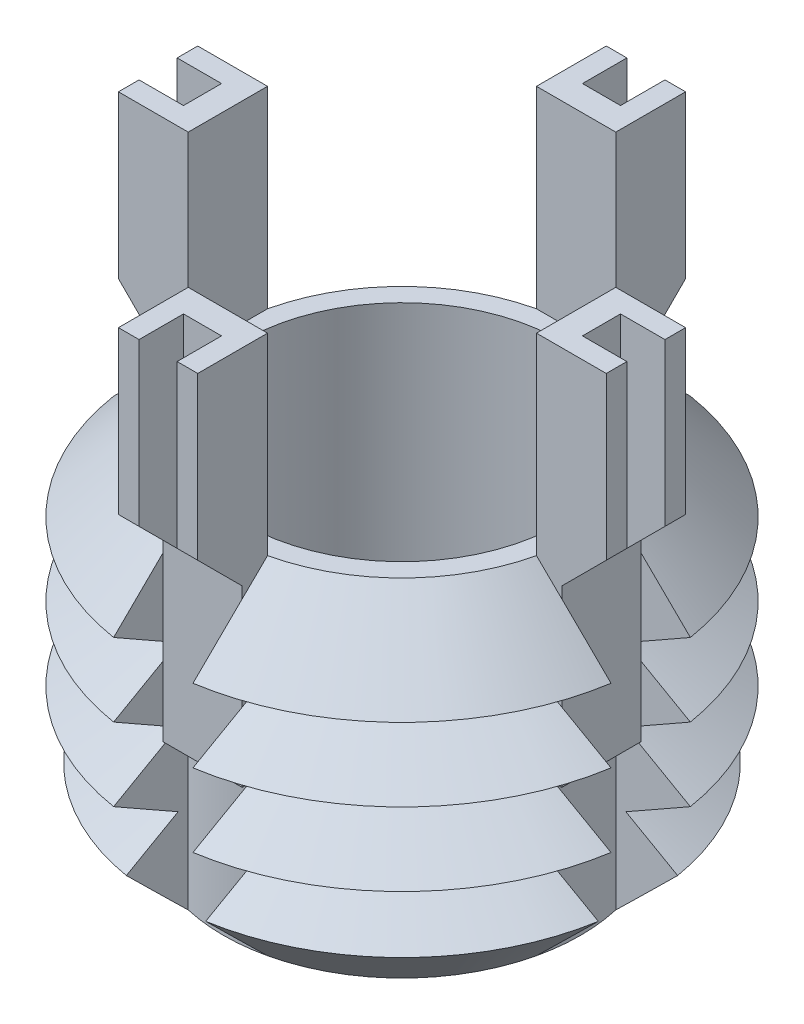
from build123d import *

# Parameters (mm, degrees)
SKETCH1_R           = 7.9375
BOSS_EXTRUDE1_DEPTH = 10.922
CHAMFER1_SIZE       = 2.309
LPATTERN1_COUNT     = 3
LPATTERN1_PITCH     = 2.309
CUT_EXTRUDE1_REACH  = 17.662
CIRPATTERN1_COUNT   = 4
BOSS_EXTRUDE3_DEPTH = 1.25
CIRPATTERN2_COUNT   = 4
CUT_EXTRUDE3_REACH  = 22.291
SKETCH6_W           = 1.4
SKETCH6_H           = 1.2
SKETCH6_W_2         = 1.2
SKETCH6_H_2         = 1.4
SKETCH7_R           = 5
CUT_EXTRUDE4_DEPTH  = 10.922


with BuildPart() as part:
    # Sketch1 → Boss-Extrude1 (new body)
    with BuildSketch(Plane(origin=(0, 0, 0), x_dir=(1, 0, 0), z_dir=(0, 1, 0))):
        with Locations(Location((0, 0, 0), (0, 0, 270))):
            Circle(SKETCH1_R)
    extrude(amount=-BOSS_EXTRUDE1_DEPTH)

    # Chamfer1
    chamfer1_edges = [part.edges().sort_by_distance(p)[0] for p in [
        (0, 0, -7.9375),
        (0, -10.922, -7.9375),
    ]]
    chamfer(chamfer1_edges, length=CHAMFER1_SIZE)

    # Sketch3 → Cut-Revolve1 (revolve, cut)
    with BuildSketch(Plane(origin=(0, 0, 0), x_dir=(0, 0, -1), z_dir=(1, 0, 0))):
        Polygon((-7.9375, -2.309), (-5.937847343, -3.4635), (-7.9375, -4.618), align=None)
    cut_revolve1 = revolve(axis=Axis((0, 0.885892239, 0), (0, -1, 0)), mode=Mode.SUBTRACT)

    # LPattern1: Cut-Revolve1 ×3
    with Locations(*[(0, -i * LPATTERN1_PITCH, 0) for i in range(1, LPATTERN1_COUNT)]):
        add(cut_revolve1, mode=Mode.SUBTRACT)

    # Cut-Extrude1: up to this cone (the profile starts inside it)
    cut_extrude1_end = Plane(origin=(0, 0, 0), z_dir=(0, 1, 0)).offset(-16.550499) * Cone(1e-06, 51.263, 51.262999, align=(Align.CENTER, Align.CENTER, Align.MIN), mode=Mode.PRIVATE)
    # Sketch4 → Cut-Extrude1 (cut, up to the surface)
    with BuildSketch(Plane(origin=(0, 0, 0), x_dir=(1, 0, 0), z_dir=(0, 1, 0)), mode=Mode.PRIVATE) as cut_extrude1_sk1:
        with BuildLine():
            Line((-5.487942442, 1.25), (-7.838456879, 1.25))
            ThreePointArc((-7.838456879, 1.25), (-7.9375, 0), (-7.838456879, -1.25))
            Line((-7.838456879, -1.25), (-5.487942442, -1.25))
            ThreePointArc((-5.487942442, -1.25), (-5.6285, 0), (-5.487942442, 1.25))
        make_face()
    cut_extrude1_tool1 = extrude(cut_extrude1_sk1.sketch, amount=-CUT_EXTRUDE1_REACH, mode=Mode.PRIVATE) & cut_extrude1_end
    cut_extrude1 = cut_extrude1_tool1.solids().sort_by_distance((-6.743037, 0, 0))[0]
    add(cut_extrude1, mode=Mode.SUBTRACT)

    # CirPattern1: Cut-Extrude1 ×4 about axis
    cirpattern1_axis = Axis((0, 0, 0), (0, 1, 0))
    for i in range(1, CIRPATTERN1_COUNT):
        add(cut_extrude1.rotate(cirpattern1_axis, i * 360 / CIRPATTERN1_COUNT), mode=Mode.SUBTRACT)

    # Sketch5 → Boss-Extrude3 (add, symmetric)
    with BuildSketch(Plane(origin=(0, 0, 0), x_dir=(0, 0, -1), z_dir=(1, 0, 0))):
        Polygon((-5.487942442, 6.073), (-5.487942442, -5.927), (-6.287942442, -5.927), (-6.287942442, -0.427), (-7.687942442, 0.973), (-7.687942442, 6.073), align=None)
    boss_extrude3 = extrude(amount=BOSS_EXTRUDE3_DEPTH, both=True)

    # CirPattern2: Boss-Extrude3 ×4 about axis
    cirpattern2_axis = Axis((0, 0, 0), (0, 1, 0))
    for i in range(1, CIRPATTERN2_COUNT):
        add(boss_extrude3.rotate(cirpattern2_axis, i * 360 / CIRPATTERN2_COUNT))

    # Cut-Extrude3: up to this plane
    cut_extrude3_end = Plane(origin=(-6.287942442, -0.427, 1.25), z_dir=(0.7071067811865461, 0.7071067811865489, -7.40655039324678e-15))
    # Sketch6 → Cut-Extrude3 (cut, up to the surface)
    with BuildSketch(Plane(origin=(0, 6.073, 0), x_dir=(1, 0, 0), z_dir=(0, 1, 0)), mode=Mode.PRIVATE) as cut_extrude3_sk1:
        with Locations((-6.987942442, 0)):
            Rectangle(SKETCH6_W, SKETCH6_H)
    cut_extrude3_tool1 = split(extrude(cut_extrude3_sk1.sketch, amount=-CUT_EXTRUDE3_REACH, mode=Mode.PRIVATE), bisect_by=cut_extrude3_end, keep=Keep.BOTH, mode=Mode.PRIVATE)
    add(cut_extrude3_tool1.solids().sort_by_distance((-6.987942, 6.073, 0))[0], mode=Mode.SUBTRACT)
    # Sketch6 → Cut-Extrude3 (cut, up to the surface)
    with BuildSketch(Plane(origin=(0, 6.073, 0), x_dir=(1, 0, 0), z_dir=(0, 1, 0)), mode=Mode.PRIVATE) as cut_extrude3_sk2:
        with Locations((0, 6.987942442)):
            Rectangle(SKETCH6_W_2, SKETCH6_H_2)
    cut_extrude3_tool2 = split(extrude(cut_extrude3_sk2.sketch, amount=-CUT_EXTRUDE3_REACH, mode=Mode.PRIVATE), bisect_by=cut_extrude3_end, keep=Keep.BOTH, mode=Mode.PRIVATE)
    add(cut_extrude3_tool2.solids().sort_by_distance((0, 6.073, -6.987942))[0], mode=Mode.SUBTRACT)
    # Sketch6 → Cut-Extrude3 (cut, up to the surface)
    with BuildSketch(Plane(origin=(0, 6.073, 0), x_dir=(1, 0, 0), z_dir=(0, 1, 0)), mode=Mode.PRIVATE) as cut_extrude3_sk3:
        with Locations((6.987942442, 0)):
            Rectangle(SKETCH6_W, SKETCH6_H)
    cut_extrude3_tool3 = split(extrude(cut_extrude3_sk3.sketch, amount=-CUT_EXTRUDE3_REACH, mode=Mode.PRIVATE), bisect_by=cut_extrude3_end, keep=Keep.BOTH, mode=Mode.PRIVATE)
    add(cut_extrude3_tool3.solids().sort_by_distance((6.987942, 6.073, 0))[0], mode=Mode.SUBTRACT)
    # Sketch6 → Cut-Extrude3 (cut, up to the surface)
    with BuildSketch(Plane(origin=(0, 6.073, 0), x_dir=(1, 0, 0), z_dir=(0, 1, 0)), mode=Mode.PRIVATE) as cut_extrude3_sk4:
        with Locations((0, -6.987942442)):
            Rectangle(SKETCH6_W_2, SKETCH6_H_2)
    cut_extrude3_tool4 = split(extrude(cut_extrude3_sk4.sketch, amount=-CUT_EXTRUDE3_REACH, mode=Mode.PRIVATE), bisect_by=cut_extrude3_end, keep=Keep.BOTH, mode=Mode.PRIVATE)
    add(cut_extrude3_tool4.solids().sort_by_distance((0, 6.073, 6.987942))[0], mode=Mode.SUBTRACT)

    # Sketch7 → Cut-Extrude4 (cut)
    with BuildSketch(Plane(origin=(0, 0, 0), x_dir=(1, 0, 0), z_dir=(0, 1, 0))):
        with Locations(Location((0, 0, 0), (0, 0, 270))):
            Circle(SKETCH7_R)
    extrude(amount=-CUT_EXTRUDE4_DEPTH, mode=Mode.SUBTRACT)


solid = part.part
